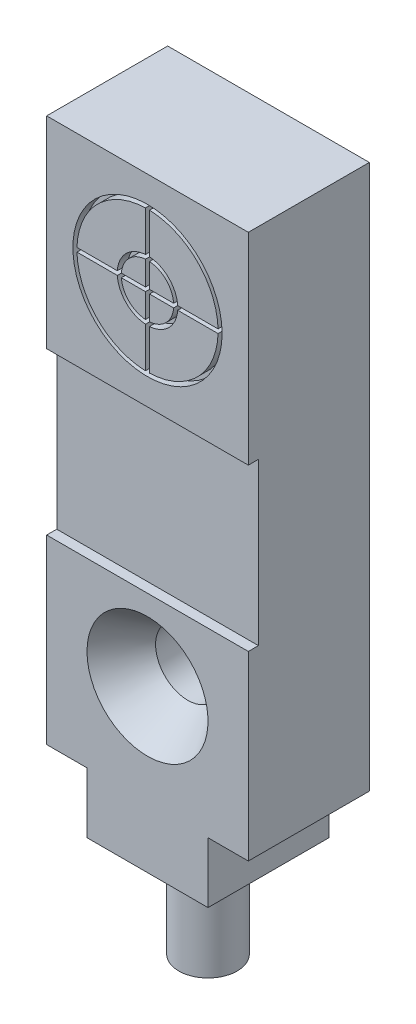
ISO-10303-21;
HEADER;
FILE_DESCRIPTION(('STEP AP214'),'2;1');
FILE_NAME('part.step','',(''),(''),'','','');
FILE_SCHEMA(('AUTOMOTIVE_DESIGN { 1 0 10303 214 1 1 1 1 }'));
ENDSEC;
DATA;
#1=APPLICATION_CONTEXT('core data for automotive mechanical design processes');
#2=APPLICATION_PROTOCOL_DEFINITION('international standard','automotive_design',2000,#1);
#3=PRODUCT_CONTEXT('',#1,'mechanical');
#4=PRODUCT('Part','Part','',(#3));
#5=PRODUCT_RELATED_PRODUCT_CATEGORY('part','',(#4));
#6=PRODUCT_DEFINITION_FORMATION('','',#4);
#7=PRODUCT_DEFINITION_CONTEXT('part definition',#1,'design');
#8=PRODUCT_DEFINITION('design','',#6,#7);
#9=PRODUCT_DEFINITION_SHAPE('','',#8);
#10=(LENGTH_UNIT() NAMED_UNIT(*) SI_UNIT(.MILLI.,.METRE.));
#11=(NAMED_UNIT(*) PLANE_ANGLE_UNIT() SI_UNIT($,.RADIAN.));
#12=(NAMED_UNIT(*) SI_UNIT($,.STERADIAN.) SOLID_ANGLE_UNIT());
#13=UNCERTAINTY_MEASURE_WITH_UNIT(LENGTH_MEASURE(1.E-05),#10,'distance_accuracy_value','');
#14=(GEOMETRIC_REPRESENTATION_CONTEXT(3) GLOBAL_UNCERTAINTY_ASSIGNED_CONTEXT((#13)) GLOBAL_UNIT_ASSIGNED_CONTEXT((#10,
#11,#12)) REPRESENTATION_CONTEXT('',''));
#15=CARTESIAN_POINT('',(0.,0.,0.));
#16=DIRECTION('',(0.,0.,1.));
#17=DIRECTION('',(1.,0.,0.));
#18=AXIS2_PLACEMENT_3D('',#15,#16,#17);
#19=CARTESIAN_POINT('',(10.,0.,6.));
#20=DIRECTION('',(0.,1.,0.));
#21=DIRECTION('',(0.,0.,1.));
#22=AXIS2_PLACEMENT_3D('',#19,#20,#21);
#23=PLANE('',#22);
#24=DIRECTION('',(0.,0.,1.));
#25=VECTOR('',#24,1.);
#26=CARTESIAN_POINT('',(8.,0.,6.));
#27=LINE('',#26,#25);
#28=CARTESIAN_POINT('',(8.,0.,0.));
#29=VERTEX_POINT('',#28);
#30=CARTESIAN_POINT('',(8.,0.,6.));
#31=VERTEX_POINT('',#30);
#32=EDGE_CURVE('E336',#29,#31,#27,.T.);
#33=ORIENTED_EDGE('',*,*,#32,.F.);
#34=DIRECTION('',(1.,0.,0.));
#35=VECTOR('',#34,1.);
#36=CARTESIAN_POINT('',(10.,0.,0.));
#37=LINE('',#36,#35);
#38=CARTESIAN_POINT('',(10.,0.,0.));
#39=VERTEX_POINT('',#38);
#40=EDGE_CURVE('E513',#29,#39,#37,.T.);
#41=ORIENTED_EDGE('',*,*,#40,.T.);
#42=DIRECTION('',(0.,0.,-1.));
#43=VECTOR('',#42,1.);
#44=CARTESIAN_POINT('',(10.,0.,6.));
#45=LINE('',#44,#43);
#46=CARTESIAN_POINT('',(10.,0.,6.));
#47=VERTEX_POINT('',#46);
#48=EDGE_CURVE('E547',#47,#39,#45,.T.);
#49=ORIENTED_EDGE('',*,*,#48,.F.);
#50=DIRECTION('',(1.,0.,0.));
#51=VECTOR('',#50,1.);
#52=CARTESIAN_POINT('',(10.,0.,6.));
#53=LINE('',#52,#51);
#54=EDGE_CURVE('E74',#31,#47,#53,.T.);
#55=ORIENTED_EDGE('',*,*,#54,.F.);
#56=EDGE_LOOP('',(#33,#41,#49,#55));
#57=FACE_BOUND('',#56,.T.);
#58=ADVANCED_FACE('F59',(#57),#23,.F.);
#59=DIRECTION('',(0.,0.,-1.));
#60=VECTOR('',#59,1.);
#61=CARTESIAN_POINT('',(2.,0.,0.));
#62=LINE('',#61,#60);
#63=CARTESIAN_POINT('',(1.99999999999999,0.,6.));
#64=VERTEX_POINT('',#63);
#65=CARTESIAN_POINT('',(2.,0.,0.));
#66=VERTEX_POINT('',#65);
#67=EDGE_CURVE('E82',#64,#66,#62,.T.);
#68=ORIENTED_EDGE('',*,*,#67,.F.);
#69=CARTESIAN_POINT('',(0.,0.,6.));
#70=VERTEX_POINT('',#69);
#71=EDGE_CURVE('E340',#70,#64,#53,.T.);
#72=ORIENTED_EDGE('',*,*,#71,.F.);
#73=DIRECTION('',(0.,0.,-1.));
#74=VECTOR('',#73,1.);
#75=CARTESIAN_POINT('',(0.,0.,6.));
#76=LINE('',#75,#74);
#77=CARTESIAN_POINT('',(0.,0.,0.));
#78=VERTEX_POINT('',#77);
#79=EDGE_CURVE('E530',#70,#78,#76,.T.);
#80=ORIENTED_EDGE('',*,*,#79,.T.);
#81=EDGE_CURVE('E531',#78,#66,#37,.T.);
#82=ORIENTED_EDGE('',*,*,#81,.T.);
#83=EDGE_LOOP('',(#68,#72,#80,#82));
#84=FACE_BOUND('',#83,.T.);
#85=ADVANCED_FACE('F710',(#84),#23,.F.);
#86=CARTESIAN_POINT('',(5.,22.,5.5));
#87=DIRECTION('',(0.,0.,1.));
#88=DIRECTION('',(1.,0.,0.));
#89=AXIS2_PLACEMENT_3D('',#86,#87,#88);
#90=CYLINDRICAL_SURFACE('',#89,3.5);
#91=CARTESIAN_POINT('',(5.,22.,5.5));
#92=DIRECTION('',(0.,0.,1.));
#93=DIRECTION('',(1.,0.,0.));
#94=AXIS2_PLACEMENT_3D('',#91,#92,#93);
#95=CIRCLE('',#94,3.5);
#96=CARTESIAN_POINT('',(1.50142886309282,21.9,5.5));
#97=VERTEX_POINT('',#96);
#98=CARTESIAN_POINT('',(4.9,18.5014288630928,5.5));
#99=VERTEX_POINT('',#98);
#100=EDGE_CURVE('E479',#97,#99,#95,.T.);
#101=ORIENTED_EDGE('',*,*,#100,.T.);
#102=DIRECTION('',(0.,0.,1.));
#103=VECTOR('',#102,1.);
#104=CARTESIAN_POINT('',(4.9,18.5014288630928,5.5));
#105=LINE('',#104,#103);
#106=CARTESIAN_POINT('',(4.9,18.5014288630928,6.));
#107=VERTEX_POINT('',#106);
#108=EDGE_CURVE('E445',#99,#107,#105,.T.);
#109=ORIENTED_EDGE('',*,*,#108,.T.);
#110=CARTESIAN_POINT('',(5.,22.,6.));
#111=DIRECTION('',(0.,0.,1.));
#112=DIRECTION('',(1.,0.,0.));
#113=AXIS2_PLACEMENT_3D('',#110,#111,#112);
#114=CIRCLE('',#113,3.5);
#115=CARTESIAN_POINT('',(1.50142886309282,21.9,6.));
#116=VERTEX_POINT('',#115);
#117=EDGE_CURVE('E484',#116,#107,#114,.T.);
#118=ORIENTED_EDGE('',*,*,#117,.F.);
#119=DIRECTION('',(0.,0.,1.));
#120=VECTOR('',#119,1.);
#121=CARTESIAN_POINT('',(1.50142886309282,21.9,5.5));
#122=LINE('',#121,#120);
#123=EDGE_CURVE('E421',#116,#97,#122,.F.);
#124=ORIENTED_EDGE('',*,*,#123,.T.);
#125=EDGE_LOOP('',(#101,#109,#118,#124));
#126=FACE_BOUND('',#125,.T.);
#127=ADVANCED_FACE('F714',(#126),#90,.T.);
#128=DIRECTION('',(0.,0.,1.));
#129=VECTOR('',#128,1.);
#130=CARTESIAN_POINT('',(5.1,18.5014288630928,5.5));
#131=LINE('',#130,#129);
#132=CARTESIAN_POINT('',(5.1,18.5014288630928,5.5));
#133=VERTEX_POINT('',#132);
#134=CARTESIAN_POINT('',(5.1,18.5014288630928,6.));
#135=VERTEX_POINT('',#134);
#136=EDGE_CURVE('E453',#133,#135,#131,.T.);
#137=ORIENTED_EDGE('',*,*,#136,.F.);
#138=CARTESIAN_POINT('',(8.49857113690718,21.9,5.5));
#139=VERTEX_POINT('',#138);
#140=EDGE_CURVE('E476',#133,#139,#95,.T.);
#141=ORIENTED_EDGE('',*,*,#140,.T.);
#142=DIRECTION('',(0.,0.,1.));
#143=VECTOR('',#142,1.);
#144=CARTESIAN_POINT('',(8.49857113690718,21.9,5.5));
#145=LINE('',#144,#143);
#146=CARTESIAN_POINT('',(8.49857113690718,21.9,6.));
#147=VERTEX_POINT('',#146);
#148=EDGE_CURVE('E399',#139,#147,#145,.T.);
#149=ORIENTED_EDGE('',*,*,#148,.T.);
#150=EDGE_CURVE('E469',#135,#147,#114,.T.);
#151=ORIENTED_EDGE('',*,*,#150,.F.);
#152=EDGE_LOOP('',(#137,#141,#149,#151));
#153=FACE_BOUND('',#152,.T.);
#154=ADVANCED_FACE('F693',(#153),#90,.T.);
#155=CARTESIAN_POINT('',(4.9,25.4985711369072,6.));
#156=VERTEX_POINT('',#155);
#157=CARTESIAN_POINT('',(1.50142886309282,22.1,6.));
#158=VERTEX_POINT('',#157);
#159=EDGE_CURVE('E946',#156,#158,#114,.T.);
#160=ORIENTED_EDGE('',*,*,#159,.F.);
#161=DIRECTION('',(0.,0.,1.));
#162=VECTOR('',#161,1.);
#163=CARTESIAN_POINT('',(4.9,25.4985711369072,5.5));
#164=LINE('',#163,#162);
#165=CARTESIAN_POINT('',(4.9,25.4985711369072,5.5));
#166=VERTEX_POINT('',#165);
#167=EDGE_CURVE('E430',#156,#166,#164,.F.);
#168=ORIENTED_EDGE('',*,*,#167,.T.);
#169=CARTESIAN_POINT('',(1.50142886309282,22.1,5.5));
#170=VERTEX_POINT('',#169);
#171=EDGE_CURVE('E950',#166,#170,#95,.T.);
#172=ORIENTED_EDGE('',*,*,#171,.T.);
#173=DIRECTION('',(0.,0.,1.));
#174=VECTOR('',#173,1.);
#175=CARTESIAN_POINT('',(1.50142886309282,22.1,5.5));
#176=LINE('',#175,#174);
#177=EDGE_CURVE('E414',#158,#170,#176,.F.);
#178=ORIENTED_EDGE('',*,*,#177,.F.);
#179=EDGE_LOOP('',(#160,#168,#172,#178));
#180=FACE_BOUND('',#179,.T.);
#181=ADVANCED_FACE('F822',(#180),#90,.T.);
#182=DIRECTION('',(0.,0.,1.));
#183=VECTOR('',#182,1.);
#184=CARTESIAN_POINT('',(5.1,25.4985711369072,5.5));
#185=LINE('',#184,#183);
#186=CARTESIAN_POINT('',(5.1,25.4985711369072,6.));
#187=VERTEX_POINT('',#186);
#188=CARTESIAN_POINT('',(5.1,25.4985711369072,5.5));
#189=VERTEX_POINT('',#188);
#190=EDGE_CURVE('E438',#187,#189,#185,.F.);
#191=ORIENTED_EDGE('',*,*,#190,.F.);
#192=CARTESIAN_POINT('',(8.49857113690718,22.1,6.));
#193=VERTEX_POINT('',#192);
#194=EDGE_CURVE('E480',#193,#187,#114,.T.);
#195=ORIENTED_EDGE('',*,*,#194,.F.);
#196=DIRECTION('',(0.,0.,1.));
#197=VECTOR('',#196,1.);
#198=CARTESIAN_POINT('',(8.49857113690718,22.1,5.5));
#199=LINE('',#198,#197);
#200=CARTESIAN_POINT('',(8.49857113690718,22.1,5.5));
#201=VERTEX_POINT('',#200);
#202=EDGE_CURVE('E407',#201,#193,#199,.T.);
#203=ORIENTED_EDGE('',*,*,#202,.F.);
#204=EDGE_CURVE('E481',#201,#189,#95,.T.);
#205=ORIENTED_EDGE('',*,*,#204,.T.);
#206=EDGE_LOOP('',(#191,#195,#203,#205));
#207=FACE_BOUND('',#206,.T.);
#208=ADVANCED_FACE('F760',(#207),#90,.T.);
#209=CARTESIAN_POINT('',(0.,0.,6.));
#210=DIRECTION('',(0.,0.,-1.));
#211=DIRECTION('',(-1.,0.,0.));
#212=AXIS2_PLACEMENT_3D('',#209,#210,#211);
#213=PLANE('',#212);
#214=DIRECTION('',(0.,1.,0.));
#215=VECTOR('',#214,1.);
#216=CARTESIAN_POINT('',(4.9,18.5,6.));
#217=LINE('',#216,#215);
#218=CARTESIAN_POINT('',(4.9,20.5033370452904,6.));
#219=VERTEX_POINT('',#218);
#220=EDGE_CURVE('E389',#107,#219,#217,.T.);
#221=ORIENTED_EDGE('',*,*,#220,.T.);
#222=CARTESIAN_POINT('',(5.,22.,6.));
#223=DIRECTION('',(0.,0.,1.));
#224=DIRECTION('',(1.,0.,0.));
#225=AXIS2_PLACEMENT_3D('',#222,#223,#224);
#226=CIRCLE('',#225,1.5);
#227=CARTESIAN_POINT('',(3.50333704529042,21.9,6.));
#228=VERTEX_POINT('',#227);
#229=EDGE_CURVE('E674',#228,#219,#226,.T.);
#230=ORIENTED_EDGE('',*,*,#229,.F.);
#231=DIRECTION('',(1.,0.,0.));
#232=VECTOR('',#231,1.);
#233=CARTESIAN_POINT('',(8.5,21.9,6.));
#234=LINE('',#233,#232);
#235=EDGE_CURVE('E361',#228,#116,#234,.F.);
#236=ORIENTED_EDGE('',*,*,#235,.T.);
#237=ORIENTED_EDGE('',*,*,#117,.T.);
#238=EDGE_LOOP('',(#221,#230,#236,#237));
#239=FACE_BOUND('',#238,.T.);
#240=ADVANCED_FACE('F737',(#239),#213,.F.);
#241=CARTESIAN_POINT('',(4.9,23.4966629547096,6.));
#242=VERTEX_POINT('',#241);
#243=EDGE_CURVE('E387',#242,#156,#217,.T.);
#244=ORIENTED_EDGE('',*,*,#243,.T.);
#245=ORIENTED_EDGE('',*,*,#159,.T.);
#246=DIRECTION('',(1.,0.,0.));
#247=VECTOR('',#246,1.);
#248=CARTESIAN_POINT('',(8.5,22.1,6.));
#249=LINE('',#248,#247);
#250=CARTESIAN_POINT('',(3.50333704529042,22.1,6.));
#251=VERTEX_POINT('',#250);
#252=EDGE_CURVE('E341',#251,#158,#249,.F.);
#253=ORIENTED_EDGE('',*,*,#252,.F.);
#254=EDGE_CURVE('E475',#242,#251,#226,.T.);
#255=ORIENTED_EDGE('',*,*,#254,.F.);
#256=EDGE_LOOP('',(#244,#245,#253,#255));
#257=FACE_BOUND('',#256,.T.);
#258=ADVANCED_FACE('F804',(#257),#213,.F.);
#259=CARTESIAN_POINT('',(5.1,20.5033370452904,6.));
#260=VERTEX_POINT('',#259);
#261=CARTESIAN_POINT('',(6.49666295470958,21.9,6.));
#262=VERTEX_POINT('',#261);
#263=EDGE_CURVE('E459',#260,#262,#226,.T.);
#264=ORIENTED_EDGE('',*,*,#263,.F.);
#265=DIRECTION('',(0.,1.,0.));
#266=VECTOR('',#265,1.);
#267=CARTESIAN_POINT('',(5.1,18.5,6.));
#268=LINE('',#267,#266);
#269=EDGE_CURVE('E385',#135,#260,#268,.T.);
#270=ORIENTED_EDGE('',*,*,#269,.F.);
#271=ORIENTED_EDGE('',*,*,#150,.T.);
#272=EDGE_CURVE('E354',#147,#262,#234,.F.);
#273=ORIENTED_EDGE('',*,*,#272,.T.);
#274=EDGE_LOOP('',(#264,#270,#271,#273));
#275=FACE_BOUND('',#274,.T.);
#276=ADVANCED_FACE('F688',(#275),#213,.F.);
#277=CARTESIAN_POINT('',(5.,22.,5.5));
#278=DIRECTION('',(0.,0.,1.));
#279=DIRECTION('',(1.,0.,0.));
#280=AXIS2_PLACEMENT_3D('',#277,#278,#279);
#281=CYLINDRICAL_SURFACE('',#280,1.5);
#282=DIRECTION('',(0.,0.,1.));
#283=VECTOR('',#282,1.);
#284=CARTESIAN_POINT('',(4.9,20.5033370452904,5.5));
#285=LINE('',#284,#283);
#286=CARTESIAN_POINT('',(4.9,20.5033370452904,5.5));
#287=VERTEX_POINT('',#286);
#288=EDGE_CURVE('E443',#287,#219,#285,.T.);
#289=ORIENTED_EDGE('',*,*,#288,.F.);
#290=CARTESIAN_POINT('',(5.,22.,5.5));
#291=DIRECTION('',(0.,0.,1.));
#292=DIRECTION('',(1.,0.,0.));
#293=AXIS2_PLACEMENT_3D('',#290,#291,#292);
#294=CIRCLE('',#293,1.5);
#295=CARTESIAN_POINT('',(3.50333704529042,21.9,5.5));
#296=VERTEX_POINT('',#295);
#297=EDGE_CURVE('E672',#296,#287,#294,.T.);
#298=ORIENTED_EDGE('',*,*,#297,.F.);
#299=DIRECTION('',(0.,0.,1.));
#300=VECTOR('',#299,1.);
#301=CARTESIAN_POINT('',(3.50333704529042,21.9,5.5));
#302=LINE('',#301,#300);
#303=EDGE_CURVE('E419',#228,#296,#302,.F.);
#304=ORIENTED_EDGE('',*,*,#303,.F.);
#305=ORIENTED_EDGE('',*,*,#229,.T.);
#306=EDGE_LOOP('',(#289,#298,#304,#305));
#307=FACE_BOUND('',#306,.T.);
#308=ADVANCED_FACE('F670',(#307),#281,.F.);
#309=DIRECTION('',(0.,0.,1.));
#310=VECTOR('',#309,1.);
#311=CARTESIAN_POINT('',(4.9,23.4966629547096,5.5));
#312=LINE('',#311,#310);
#313=CARTESIAN_POINT('',(4.9,23.4966629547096,5.5));
#314=VERTEX_POINT('',#313);
#315=EDGE_CURVE('E427',#242,#314,#312,.F.);
#316=ORIENTED_EDGE('',*,*,#315,.F.);
#317=ORIENTED_EDGE('',*,*,#254,.T.);
#318=DIRECTION('',(0.,0.,1.));
#319=VECTOR('',#318,1.);
#320=CARTESIAN_POINT('',(3.50333704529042,22.1,5.5));
#321=LINE('',#320,#319);
#322=CARTESIAN_POINT('',(3.50333704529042,22.1,5.5));
#323=VERTEX_POINT('',#322);
#324=EDGE_CURVE('E411',#251,#323,#321,.F.);
#325=ORIENTED_EDGE('',*,*,#324,.T.);
#326=EDGE_CURVE('E470',#314,#323,#294,.T.);
#327=ORIENTED_EDGE('',*,*,#326,.F.);
#328=EDGE_LOOP('',(#316,#317,#325,#327));
#329=FACE_BOUND('',#328,.T.);
#330=ADVANCED_FACE('F787',(#329),#281,.F.);
#331=CARTESIAN_POINT('',(5.1,20.5033370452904,5.5));
#332=VERTEX_POINT('',#331);
#333=CARTESIAN_POINT('',(6.49666295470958,21.9,5.5));
#334=VERTEX_POINT('',#333);
#335=EDGE_CURVE('E471',#332,#334,#294,.T.);
#336=ORIENTED_EDGE('',*,*,#335,.F.);
#337=DIRECTION('',(0.,0.,1.));
#338=VECTOR('',#337,1.);
#339=CARTESIAN_POINT('',(5.1,20.5033370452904,5.5));
#340=LINE('',#339,#338);
#341=EDGE_CURVE('E450',#332,#260,#340,.T.);
#342=ORIENTED_EDGE('',*,*,#341,.T.);
#343=ORIENTED_EDGE('',*,*,#263,.T.);
#344=DIRECTION('',(0.,0.,1.));
#345=VECTOR('',#344,1.);
#346=CARTESIAN_POINT('',(6.49666295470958,21.9,5.5));
#347=LINE('',#346,#345);
#348=EDGE_CURVE('E397',#334,#262,#347,.T.);
#349=ORIENTED_EDGE('',*,*,#348,.F.);
#350=EDGE_LOOP('',(#336,#342,#343,#349));
#351=FACE_BOUND('',#350,.T.);
#352=ADVANCED_FACE('F681',(#351),#281,.F.);
#353=CARTESIAN_POINT('',(5.,22.,5.5));
#354=DIRECTION('',(0.,0.,1.));
#355=DIRECTION('',(1.,0.,0.));
#356=AXIS2_PLACEMENT_3D('',#353,#354,#355);
#357=CYLINDRICAL_SURFACE('',#356,1.3);
#358=CARTESIAN_POINT('',(5.,22.,5.5));
#359=DIRECTION('',(0.,0.,1.));
#360=DIRECTION('',(1.,0.,0.));
#361=AXIS2_PLACEMENT_3D('',#358,#359,#360);
#362=CIRCLE('',#361,1.3);
#363=CARTESIAN_POINT('',(3.70385186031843,21.9,5.5));
#364=VERTEX_POINT('',#363);
#365=CARTESIAN_POINT('',(4.9,20.7038518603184,5.5));
#366=VERTEX_POINT('',#365);
#367=EDGE_CURVE('E578',#364,#366,#362,.T.);
#368=ORIENTED_EDGE('',*,*,#367,.T.);
#369=DIRECTION('',(0.,0.,1.));
#370=VECTOR('',#369,1.);
#371=CARTESIAN_POINT('',(4.9,20.7038518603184,5.5));
#372=LINE('',#371,#370);
#373=CARTESIAN_POINT('',(4.9,20.7038518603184,6.));
#374=VERTEX_POINT('',#373);
#375=EDGE_CURVE('E440',#366,#374,#372,.T.);
#376=ORIENTED_EDGE('',*,*,#375,.T.);
#377=CARTESIAN_POINT('',(5.,22.,6.));
#378=DIRECTION('',(0.,0.,1.));
#379=DIRECTION('',(1.,0.,0.));
#380=AXIS2_PLACEMENT_3D('',#377,#378,#379);
#381=CIRCLE('',#380,1.3);
#382=CARTESIAN_POINT('',(3.70385186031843,21.9,6.));
#383=VERTEX_POINT('',#382);
#384=EDGE_CURVE('E576',#383,#374,#381,.T.);
#385=ORIENTED_EDGE('',*,*,#384,.F.);
#386=DIRECTION('',(0.,0.,1.));
#387=VECTOR('',#386,1.);
#388=CARTESIAN_POINT('',(3.70385186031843,21.9,5.5));
#389=LINE('',#388,#387);
#390=EDGE_CURVE('E416',#383,#364,#389,.F.);
#391=ORIENTED_EDGE('',*,*,#390,.T.);
#392=EDGE_LOOP('',(#368,#376,#385,#391));
#393=FACE_BOUND('',#392,.T.);
#394=ADVANCED_FACE('F575',(#393),#357,.T.);
#395=CARTESIAN_POINT('',(4.9,23.2961481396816,6.));
#396=VERTEX_POINT('',#395);
#397=CARTESIAN_POINT('',(3.70385186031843,22.1,6.));
#398=VERTEX_POINT('',#397);
#399=EDGE_CURVE('E465',#396,#398,#381,.T.);
#400=ORIENTED_EDGE('',*,*,#399,.F.);
#401=DIRECTION('',(0.,0.,1.));
#402=VECTOR('',#401,1.);
#403=CARTESIAN_POINT('',(4.9,23.2961481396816,5.5));
#404=LINE('',#403,#402);
#405=CARTESIAN_POINT('',(4.9,23.2961481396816,5.5));
#406=VERTEX_POINT('',#405);
#407=EDGE_CURVE('E424',#396,#406,#404,.F.);
#408=ORIENTED_EDGE('',*,*,#407,.T.);
#409=CARTESIAN_POINT('',(3.70385186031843,22.1,5.5));
#410=VERTEX_POINT('',#409);
#411=EDGE_CURVE('E460',#406,#410,#362,.T.);
#412=ORIENTED_EDGE('',*,*,#411,.T.);
#413=DIRECTION('',(0.,0.,1.));
#414=VECTOR('',#413,1.);
#415=CARTESIAN_POINT('',(3.70385186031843,22.1,5.5));
#416=LINE('',#415,#414);
#417=EDGE_CURVE('E409',#398,#410,#416,.F.);
#418=ORIENTED_EDGE('',*,*,#417,.F.);
#419=EDGE_LOOP('',(#400,#408,#412,#418));
#420=FACE_BOUND('',#419,.T.);
#421=ADVANCED_FACE('F609',(#420),#357,.T.);
#422=DIRECTION('',(0.,0.,1.));
#423=VECTOR('',#422,1.);
#424=CARTESIAN_POINT('',(5.1,20.7038518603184,5.5));
#425=LINE('',#424,#423);
#426=CARTESIAN_POINT('',(5.1,20.7038518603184,5.5));
#427=VERTEX_POINT('',#426);
#428=CARTESIAN_POINT('',(5.1,20.7038518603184,6.));
#429=VERTEX_POINT('',#428);
#430=EDGE_CURVE('E448',#427,#429,#425,.T.);
#431=ORIENTED_EDGE('',*,*,#430,.F.);
#432=CARTESIAN_POINT('',(6.29614813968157,21.9,5.5));
#433=VERTEX_POINT('',#432);
#434=EDGE_CURVE('E461',#427,#433,#362,.T.);
#435=ORIENTED_EDGE('',*,*,#434,.T.);
#436=DIRECTION('',(0.,0.,1.));
#437=VECTOR('',#436,1.);
#438=CARTESIAN_POINT('',(6.29614813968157,21.9,5.5));
#439=LINE('',#438,#437);
#440=CARTESIAN_POINT('',(6.29614813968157,21.9,6.));
#441=VERTEX_POINT('',#440);
#442=EDGE_CURVE('E394',#433,#441,#439,.T.);
#443=ORIENTED_EDGE('',*,*,#442,.T.);
#444=EDGE_CURVE('E455',#429,#441,#381,.T.);
#445=ORIENTED_EDGE('',*,*,#444,.F.);
#446=EDGE_LOOP('',(#431,#435,#443,#445));
#447=FACE_BOUND('',#446,.T.);
#448=ADVANCED_FACE('F589',(#447),#357,.T.);
#449=DIRECTION('',(0.,-1.,0.));
#450=VECTOR('',#449,1.);
#451=CARTESIAN_POINT('',(4.9,0.,6.));
#452=LINE('',#451,#450);
#453=CARTESIAN_POINT('',(4.9,21.9,6.));
#454=VERTEX_POINT('',#453);
#455=EDGE_CURVE('E67',#454,#374,#452,.T.);
#456=ORIENTED_EDGE('',*,*,#455,.F.);
#457=EDGE_CURVE('E364',#454,#383,#234,.F.);
#458=ORIENTED_EDGE('',*,*,#457,.T.);
#459=ORIENTED_EDGE('',*,*,#384,.T.);
#460=EDGE_LOOP('',(#456,#458,#459));
#461=FACE_BOUND('',#460,.T.);
#462=ADVANCED_FACE('F579',(#461),#213,.F.);
#463=CARTESIAN_POINT('',(4.9,22.1,6.));
#464=VERTEX_POINT('',#463);
#465=EDGE_CURVE('E393',#464,#396,#217,.T.);
#466=ORIENTED_EDGE('',*,*,#465,.T.);
#467=ORIENTED_EDGE('',*,*,#399,.T.);
#468=EDGE_CURVE('E343',#464,#398,#249,.F.);
#469=ORIENTED_EDGE('',*,*,#468,.F.);
#470=EDGE_LOOP('',(#466,#467,#469));
#471=FACE_BOUND('',#470,.T.);
#472=ADVANCED_FACE('F774',(#471),#213,.F.);
#473=CARTESIAN_POINT('',(6.29614813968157,22.1,6.));
#474=VERTEX_POINT('',#473);
#475=CARTESIAN_POINT('',(5.1,23.2961481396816,6.));
#476=VERTEX_POINT('',#475);
#477=EDGE_CURVE('E462',#474,#476,#381,.T.);
#478=ORIENTED_EDGE('',*,*,#477,.T.);
#479=CARTESIAN_POINT('',(5.1,22.1,6.));
#480=VERTEX_POINT('',#479);
#481=EDGE_CURVE('E388',#480,#476,#268,.T.);
#482=ORIENTED_EDGE('',*,*,#481,.F.);
#483=DIRECTION('',(1.,0.,0.));
#484=VECTOR('',#483,1.);
#485=CARTESIAN_POINT('',(0.,22.1,6.));
#486=LINE('',#485,#484);
#487=EDGE_CURVE('E561',#480,#474,#486,.T.);
#488=ORIENTED_EDGE('',*,*,#487,.T.);
#489=EDGE_LOOP('',(#478,#482,#488));
#490=FACE_BOUND('',#489,.T.);
#491=ADVANCED_FACE('F650',(#490),#213,.F.);
#492=CARTESIAN_POINT('',(5.,5.,6.));
#493=DIRECTION('',(0.,0.,-1.));
#494=DIRECTION('',(-1.,0.,0.));
#495=AXIS2_PLACEMENT_3D('',#492,#493,#494);
#496=CIRCLE('',#495,3.00000000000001);
#497=CARTESIAN_POINT('',(1.99999999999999,5.,6.));
#498=VERTEX_POINT('',#497);
#499=EDGE_CURVE('E553',#498,#498,#496,.T.);
#500=ORIENTED_EDGE('',*,*,#499,.T.);
#501=EDGE_LOOP('',(#500));
#502=FACE_BOUND('',#501,.T.);
#503=DIRECTION('',(0.,1.,0.));
#504=VECTOR('',#503,1.);
#505=CARTESIAN_POINT('',(10.,27.,6.));
#506=LINE('',#505,#504);
#507=CARTESIAN_POINT('',(10.,9.,6.));
#508=VERTEX_POINT('',#507);
#509=EDGE_CURVE('E522',#47,#508,#506,.T.);
#510=ORIENTED_EDGE('',*,*,#509,.T.);
#511=DIRECTION('',(1.,0.,0.));
#512=VECTOR('',#511,1.);
#513=CARTESIAN_POINT('',(10.,9.,6.));
#514=LINE('',#513,#512);
#515=CARTESIAN_POINT('',(0.,9.,6.));
#516=VERTEX_POINT('',#515);
#517=EDGE_CURVE('E499',#516,#508,#514,.T.);
#518=ORIENTED_EDGE('',*,*,#517,.F.);
#519=DIRECTION('',(0.,-1.,0.));
#520=VECTOR('',#519,1.);
#521=CARTESIAN_POINT('',(0.,0.,6.));
#522=LINE('',#521,#520);
#523=EDGE_CURVE('E526',#516,#70,#522,.T.);
#524=ORIENTED_EDGE('',*,*,#523,.T.);
#525=ORIENTED_EDGE('',*,*,#71,.T.);
#526=DIRECTION('',(0.,1.,0.));
#527=VECTOR('',#526,1.);
#528=CARTESIAN_POINT('',(1.99999999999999,-3.,6.));
#529=LINE('',#528,#527);
#530=CARTESIAN_POINT('',(1.99999999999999,-3.,6.));
#531=VERTEX_POINT('',#530);
#532=EDGE_CURVE('E321',#531,#64,#529,.T.);
#533=ORIENTED_EDGE('',*,*,#532,.F.);
#534=DIRECTION('',(-1.,0.,0.));
#535=VECTOR('',#534,1.);
#536=CARTESIAN_POINT('',(1.99999999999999,-3.,6.));
#537=LINE('',#536,#535);
#538=CARTESIAN_POINT('',(8.,-3.,6.));
#539=VERTEX_POINT('',#538);
#540=EDGE_CURVE('E327',#539,#531,#537,.T.);
#541=ORIENTED_EDGE('',*,*,#540,.F.);
#542=DIRECTION('',(0.,1.,0.));
#543=VECTOR('',#542,1.);
#544=CARTESIAN_POINT('',(8.,-3.,6.));
#545=LINE('',#544,#543);
#546=EDGE_CURVE('E1179',#539,#31,#545,.T.);
#547=ORIENTED_EDGE('',*,*,#546,.T.);
#548=ORIENTED_EDGE('',*,*,#54,.T.);
#549=EDGE_LOOP('',(#510,#518,#524,#525,#533,#541,#547,#548));
#550=FACE_BOUND('',#549,.T.);
#551=ADVANCED_FACE('F339',(#502,#550),#213,.F.);
#552=CARTESIAN_POINT('',(10.,27.,6.));
#553=DIRECTION('',(-1.,0.,0.));
#554=DIRECTION('',(0.,0.,1.));
#555=AXIS2_PLACEMENT_3D('',#552,#553,#554);
#556=PLANE('',#555);
#557=DIRECTION('',(0.,1.,0.));
#558=VECTOR('',#557,1.);
#559=CARTESIAN_POINT('',(10.,17.,5.5));
#560=LINE('',#559,#558);
#561=CARTESIAN_POINT('',(10.,9.,5.5));
#562=VERTEX_POINT('',#561);
#563=CARTESIAN_POINT('',(10.,17.,5.5));
#564=VERTEX_POINT('',#563);
#565=EDGE_CURVE('E495',#562,#564,#560,.T.);
#566=ORIENTED_EDGE('',*,*,#565,.F.);
#567=DIRECTION('',(0.,0.,1.));
#568=VECTOR('',#567,1.);
#569=CARTESIAN_POINT('',(10.,9.,5.5));
#570=LINE('',#569,#568);
#571=EDGE_CURVE('E510',#562,#508,#570,.T.);
#572=ORIENTED_EDGE('',*,*,#571,.T.);
#573=ORIENTED_EDGE('',*,*,#509,.F.);
#574=ORIENTED_EDGE('',*,*,#48,.T.);
#575=DIRECTION('',(0.,1.,0.));
#576=VECTOR('',#575,1.);
#577=CARTESIAN_POINT('',(10.,27.,0.));
#578=LINE('',#577,#576);
#579=CARTESIAN_POINT('',(10.,27.,0.));
#580=VERTEX_POINT('',#579);
#581=EDGE_CURVE('E533',#39,#580,#578,.T.);
#582=ORIENTED_EDGE('',*,*,#581,.T.);
#583=DIRECTION('',(0.,0.,-1.));
#584=VECTOR('',#583,1.);
#585=CARTESIAN_POINT('',(10.,27.,6.));
#586=LINE('',#585,#584);
#587=CARTESIAN_POINT('',(10.,27.,6.));
#588=VERTEX_POINT('',#587);
#589=EDGE_CURVE('E544',#588,#580,#586,.T.);
#590=ORIENTED_EDGE('',*,*,#589,.F.);
#591=CARTESIAN_POINT('',(10.,17.,6.));
#592=VERTEX_POINT('',#591);
#593=EDGE_CURVE('E521',#592,#588,#506,.T.);
#594=ORIENTED_EDGE('',*,*,#593,.F.);
#595=DIRECTION('',(0.,0.,1.));
#596=VECTOR('',#595,1.);
#597=CARTESIAN_POINT('',(10.,17.,5.5));
#598=LINE('',#597,#596);
#599=EDGE_CURVE('E507',#564,#592,#598,.T.);
#600=ORIENTED_EDGE('',*,*,#599,.F.);
#601=EDGE_LOOP('',(#566,#572,#573,#574,#582,#590,#594,#600));
#602=FACE_BOUND('',#601,.T.);
#603=ADVANCED_FACE('F716',(#602),#556,.F.);
#604=CARTESIAN_POINT('',(0.,27.,6.));
#605=DIRECTION('',(0.,-1.,0.));
#606=DIRECTION('',(0.,0.,-1.));
#607=AXIS2_PLACEMENT_3D('',#604,#605,#606);
#608=PLANE('',#607);
#609=DIRECTION('',(-1.,0.,0.));
#610=VECTOR('',#609,1.);
#611=CARTESIAN_POINT('',(0.,27.,0.));
#612=LINE('',#611,#610);
#613=CARTESIAN_POINT('',(0.,27.,0.));
#614=VERTEX_POINT('',#613);
#615=EDGE_CURVE('E535',#580,#614,#612,.T.);
#616=ORIENTED_EDGE('',*,*,#615,.T.);
#617=DIRECTION('',(0.,0.,-1.));
#618=VECTOR('',#617,1.);
#619=CARTESIAN_POINT('',(0.,27.,6.));
#620=LINE('',#619,#618);
#621=CARTESIAN_POINT('',(0.,27.,6.));
#622=VERTEX_POINT('',#621);
#623=EDGE_CURVE('E541',#622,#614,#620,.T.);
#624=ORIENTED_EDGE('',*,*,#623,.F.);
#625=DIRECTION('',(-1.,0.,0.));
#626=VECTOR('',#625,1.);
#627=CARTESIAN_POINT('',(0.,27.,6.));
#628=LINE('',#627,#626);
#629=EDGE_CURVE('E524',#588,#622,#628,.T.);
#630=ORIENTED_EDGE('',*,*,#629,.F.);
#631=ORIENTED_EDGE('',*,*,#589,.T.);
#632=EDGE_LOOP('',(#616,#624,#630,#631));
#633=FACE_BOUND('',#632,.T.);
#634=ADVANCED_FACE('F719',(#633),#608,.F.);
#635=CARTESIAN_POINT('',(0.,0.,6.));
#636=DIRECTION('',(1.,0.,0.));
#637=DIRECTION('',(0.,0.,-1.));
#638=AXIS2_PLACEMENT_3D('',#635,#636,#637);
#639=PLANE('',#638);
#640=ORIENTED_EDGE('',*,*,#523,.F.);
#641=DIRECTION('',(0.,0.,1.));
#642=VECTOR('',#641,1.);
#643=CARTESIAN_POINT('',(0.,9.,5.5));
#644=LINE('',#643,#642);
#645=CARTESIAN_POINT('',(0.,9.,5.5));
#646=VERTEX_POINT('',#645);
#647=EDGE_CURVE('E514',#646,#516,#644,.T.);
#648=ORIENTED_EDGE('',*,*,#647,.F.);
#649=DIRECTION('',(0.,-1.,0.));
#650=VECTOR('',#649,1.);
#651=CARTESIAN_POINT('',(0.,9.,5.5));
#652=LINE('',#651,#650);
#653=CARTESIAN_POINT('',(0.,17.,5.5));
#654=VERTEX_POINT('',#653);
#655=EDGE_CURVE('E502',#654,#646,#652,.T.);
#656=ORIENTED_EDGE('',*,*,#655,.F.);
#657=DIRECTION('',(0.,0.,1.));
#658=VECTOR('',#657,1.);
#659=CARTESIAN_POINT('',(0.,17.,5.5));
#660=LINE('',#659,#658);
#661=CARTESIAN_POINT('',(0.,17.,6.));
#662=VERTEX_POINT('',#661);
#663=EDGE_CURVE('E516',#654,#662,#660,.T.);
#664=ORIENTED_EDGE('',*,*,#663,.T.);
#665=EDGE_CURVE('E527',#622,#662,#522,.T.);
#666=ORIENTED_EDGE('',*,*,#665,.F.);
#667=ORIENTED_EDGE('',*,*,#623,.T.);
#668=DIRECTION('',(0.,-1.,0.));
#669=VECTOR('',#668,1.);
#670=CARTESIAN_POINT('',(0.,0.,0.));
#671=LINE('',#670,#669);
#672=EDGE_CURVE('E537',#614,#78,#671,.T.);
#673=ORIENTED_EDGE('',*,*,#672,.T.);
#674=ORIENTED_EDGE('',*,*,#79,.F.);
#675=EDGE_LOOP('',(#640,#648,#656,#664,#666,#667,#673,#674));
#676=FACE_BOUND('',#675,.T.);
#677=ADVANCED_FACE('F723',(#676),#639,.F.);
#678=CARTESIAN_POINT('',(5.,22.,6.));
#679=DIRECTION('',(0.,0.,1.));
#680=DIRECTION('',(1.,0.,0.));
#681=AXIS2_PLACEMENT_3D('',#678,#679,#680);
#682=CIRCLE('',#681,3.7);
#683=CARTESIAN_POINT('',(8.7,22.,6.));
#684=VERTEX_POINT('',#683);
#685=EDGE_CURVE('E489',#684,#684,#682,.T.);
#686=ORIENTED_EDGE('',*,*,#685,.F.);
#687=EDGE_LOOP('',(#686));
#688=FACE_BOUND('',#687,.T.);
#689=ORIENTED_EDGE('',*,*,#665,.T.);
#690=DIRECTION('',(-1.,0.,0.));
#691=VECTOR('',#690,1.);
#692=CARTESIAN_POINT('',(0.,17.,6.));
#693=LINE('',#692,#691);
#694=EDGE_CURVE('E494',#592,#662,#693,.T.);
#695=ORIENTED_EDGE('',*,*,#694,.F.);
#696=ORIENTED_EDGE('',*,*,#593,.T.);
#697=ORIENTED_EDGE('',*,*,#629,.T.);
#698=EDGE_LOOP('',(#689,#695,#696,#697));
#699=FACE_BOUND('',#698,.T.);
#700=ADVANCED_FACE('F727',(#688,#699),#213,.F.);
#701=CARTESIAN_POINT('',(0.,0.,0.));
#702=DIRECTION('',(0.,0.,-1.));
#703=DIRECTION('',(-1.,0.,0.));
#704=AXIS2_PLACEMENT_3D('',#701,#702,#703);
#705=PLANE('',#704);
#706=CARTESIAN_POINT('',(5.,5.,0.));
#707=DIRECTION('',(0.,0.,1.));
#708=DIRECTION('',(1.,0.,0.));
#709=AXIS2_PLACEMENT_3D('',#706,#707,#708);
#710=CIRCLE('',#709,1.6);
#711=CARTESIAN_POINT('',(6.6,5.,0.));
#712=VERTEX_POINT('',#711);
#713=EDGE_CURVE('E488',#712,#712,#710,.T.);
#714=ORIENTED_EDGE('',*,*,#713,.T.);
#715=EDGE_LOOP('',(#714));
#716=FACE_BOUND('',#715,.T.);
#717=ORIENTED_EDGE('',*,*,#81,.F.);
#718=ORIENTED_EDGE('',*,*,#672,.F.);
#719=ORIENTED_EDGE('',*,*,#615,.F.);
#720=ORIENTED_EDGE('',*,*,#581,.F.);
#721=ORIENTED_EDGE('',*,*,#40,.F.);
#722=DIRECTION('',(0.,1.,0.));
#723=VECTOR('',#722,1.);
#724=CARTESIAN_POINT('',(8.,-3.,0.));
#725=LINE('',#724,#723);
#726=CARTESIAN_POINT('',(8.,-3.,0.));
#727=VERTEX_POINT('',#726);
#728=EDGE_CURVE('E346',#727,#29,#725,.T.);
#729=ORIENTED_EDGE('',*,*,#728,.F.);
#730=DIRECTION('',(1.,0.,0.));
#731=VECTOR('',#730,1.);
#732=CARTESIAN_POINT('',(8.,-3.,0.));
#733=LINE('',#732,#731);
#734=CARTESIAN_POINT('',(2.,-3.,0.));
#735=VERTEX_POINT('',#734);
#736=EDGE_CURVE('E326',#735,#727,#733,.T.);
#737=ORIENTED_EDGE('',*,*,#736,.F.);
#738=DIRECTION('',(0.,1.,0.));
#739=VECTOR('',#738,1.);
#740=CARTESIAN_POINT('',(2.,-3.,0.));
#741=LINE('',#740,#739);
#742=EDGE_CURVE('E323',#735,#66,#741,.T.);
#743=ORIENTED_EDGE('',*,*,#742,.T.);
#744=EDGE_LOOP('',(#717,#718,#719,#720,#721,#729,#737,#743));
#745=FACE_BOUND('',#744,.T.);
#746=ADVANCED_FACE('F729',(#716,#745),#705,.T.);
#747=CARTESIAN_POINT('',(10.,9.,5.5));
#748=DIRECTION('',(0.,-1.,0.));
#749=DIRECTION('',(1.,0.,0.));
#750=AXIS2_PLACEMENT_3D('',#747,#748,#749);
#751=PLANE('',#750);
#752=ORIENTED_EDGE('',*,*,#517,.T.);
#753=ORIENTED_EDGE('',*,*,#571,.F.);
#754=DIRECTION('',(1.,0.,0.));
#755=VECTOR('',#754,1.);
#756=CARTESIAN_POINT('',(10.,9.,5.5));
#757=LINE('',#756,#755);
#758=EDGE_CURVE('E504',#646,#562,#757,.T.);
#759=ORIENTED_EDGE('',*,*,#758,.F.);
#760=ORIENTED_EDGE('',*,*,#647,.T.);
#761=EDGE_LOOP('',(#752,#753,#759,#760));
#762=FACE_BOUND('',#761,.T.);
#763=ADVANCED_FACE('F732',(#762),#751,.F.);
#764=CARTESIAN_POINT('',(0.,17.,5.5));
#765=DIRECTION('',(0.,1.,0.));
#766=DIRECTION('',(0.,0.,1.));
#767=AXIS2_PLACEMENT_3D('',#764,#765,#766);
#768=PLANE('',#767);
#769=ORIENTED_EDGE('',*,*,#694,.T.);
#770=ORIENTED_EDGE('',*,*,#663,.F.);
#771=DIRECTION('',(-1.,0.,0.));
#772=VECTOR('',#771,1.);
#773=CARTESIAN_POINT('',(0.,17.,5.5));
#774=LINE('',#773,#772);
#775=EDGE_CURVE('E498',#564,#654,#774,.T.);
#776=ORIENTED_EDGE('',*,*,#775,.F.);
#777=ORIENTED_EDGE('',*,*,#599,.T.);
#778=EDGE_LOOP('',(#769,#770,#776,#777));
#779=FACE_BOUND('',#778,.T.);
#780=ADVANCED_FACE('F738',(#779),#768,.F.);
#781=CARTESIAN_POINT('',(0.,0.,5.5));
#782=DIRECTION('',(0.,0.,-1.));
#783=DIRECTION('',(-1.,0.,0.));
#784=AXIS2_PLACEMENT_3D('',#781,#782,#783);
#785=PLANE('',#784);
#786=ORIENTED_EDGE('',*,*,#565,.T.);
#787=ORIENTED_EDGE('',*,*,#775,.T.);
#788=ORIENTED_EDGE('',*,*,#655,.T.);
#789=ORIENTED_EDGE('',*,*,#758,.T.);
#790=EDGE_LOOP('',(#786,#787,#788,#789));
#791=FACE_BOUND('',#790,.T.);
#792=ADVANCED_FACE('F741',(#791),#785,.F.);
#793=CARTESIAN_POINT('',(5.,5.,0.));
#794=DIRECTION('',(0.,0.,1.));
#795=DIRECTION('',(1.,0.,0.));
#796=AXIS2_PLACEMENT_3D('',#793,#794,#795);
#797=CYLINDRICAL_SURFACE('',#796,1.6);
#798=CARTESIAN_POINT('',(5.,5.,3.99999999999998));
#799=DIRECTION('',(0.,0.,-1.));
#800=DIRECTION('',(-1.,0.,0.));
#801=AXIS2_PLACEMENT_3D('',#798,#799,#800);
#802=CIRCLE('',#801,1.6);
#803=CARTESIAN_POINT('',(3.4,5.,3.99999999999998));
#804=VERTEX_POINT('',#803);
#805=EDGE_CURVE('E550',#804,#804,#802,.F.);
#806=ORIENTED_EDGE('',*,*,#805,.T.);
#807=EDGE_LOOP('',(#806));
#808=FACE_BOUND('',#807,.T.);
#809=ORIENTED_EDGE('',*,*,#713,.F.);
#810=EDGE_LOOP('',(#809));
#811=FACE_BOUND('',#810,.T.);
#812=ADVANCED_FACE('F748',(#808,#811),#797,.F.);
#813=CARTESIAN_POINT('',(5.,5.,3.99999999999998));
#814=DIRECTION('',(0.,0.,1.));
#815=DIRECTION('',(1.,0.,0.));
#816=AXIS2_PLACEMENT_3D('',#813,#814,#815);
#817=CONICAL_SURFACE('',#816,1.6,0.610725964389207);
#818=ORIENTED_EDGE('',*,*,#499,.F.);
#819=EDGE_LOOP('',(#818));
#820=FACE_BOUND('',#819,.T.);
#821=ORIENTED_EDGE('',*,*,#805,.F.);
#822=EDGE_LOOP('',(#821));
#823=FACE_BOUND('',#822,.T.);
#824=ADVANCED_FACE('F61',(#820,#823),#817,.F.);
#825=CARTESIAN_POINT('',(5.,22.,5.5));
#826=DIRECTION('',(0.,0.,1.));
#827=DIRECTION('',(1.,0.,0.));
#828=AXIS2_PLACEMENT_3D('',#825,#826,#827);
#829=CYLINDRICAL_SURFACE('',#828,3.7);
#830=CARTESIAN_POINT('',(5.,22.,5.5));
#831=DIRECTION('',(0.,0.,1.));
#832=DIRECTION('',(1.,0.,0.));
#833=AXIS2_PLACEMENT_3D('',#830,#831,#832);
#834=CIRCLE('',#833,3.7);
#835=CARTESIAN_POINT('',(8.7,22.,5.5));
#836=VERTEX_POINT('',#835);
#837=EDGE_CURVE('E485',#836,#836,#834,.T.);
#838=ORIENTED_EDGE('',*,*,#837,.F.);
#839=EDGE_LOOP('',(#838));
#840=FACE_BOUND('',#839,.T.);
#841=ORIENTED_EDGE('',*,*,#685,.T.);
#842=EDGE_LOOP('',(#841));
#843=FACE_BOUND('',#842,.T.);
#844=ADVANCED_FACE('F753',(#840,#843),#829,.F.);
#845=CARTESIAN_POINT('',(5.,22.,5.5));
#846=DIRECTION('',(0.,0.,1.));
#847=DIRECTION('',(1.,0.,0.));
#848=AXIS2_PLACEMENT_3D('',#845,#846,#847);
#849=PLANE('',#848);
#850=ORIENTED_EDGE('',*,*,#140,.F.);
#851=DIRECTION('',(0.,1.,0.));
#852=VECTOR('',#851,1.);
#853=CARTESIAN_POINT('',(5.1,18.5,5.5));
#854=LINE('',#853,#852);
#855=EDGE_CURVE('E379',#133,#332,#854,.T.);
#856=ORIENTED_EDGE('',*,*,#855,.T.);
#857=ORIENTED_EDGE('',*,*,#335,.T.);
#858=DIRECTION('',(1.,0.,0.));
#859=VECTOR('',#858,1.);
#860=CARTESIAN_POINT('',(8.5,21.9,5.5));
#861=LINE('',#860,#859);
#862=EDGE_CURVE('E368',#139,#334,#861,.F.);
#863=ORIENTED_EDGE('',*,*,#862,.F.);
#864=EDGE_LOOP('',(#850,#856,#857,#863));
#865=FACE_BOUND('',#864,.T.);
#866=DIRECTION('',(0.,1.,0.));
#867=VECTOR('',#866,1.);
#868=CARTESIAN_POINT('',(4.9,18.5,5.5));
#869=LINE('',#868,#867);
#870=EDGE_CURVE('E383',#99,#287,#869,.T.);
#871=ORIENTED_EDGE('',*,*,#870,.F.);
#872=ORIENTED_EDGE('',*,*,#100,.F.);
#873=EDGE_CURVE('E356',#296,#97,#861,.F.);
#874=ORIENTED_EDGE('',*,*,#873,.F.);
#875=ORIENTED_EDGE('',*,*,#297,.T.);
#876=EDGE_LOOP('',(#871,#872,#874,#875));
#877=FACE_BOUND('',#876,.T.);
#878=CARTESIAN_POINT('',(5.1,23.4966629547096,5.5));
#879=VERTEX_POINT('',#878);
#880=EDGE_CURVE('E392',#879,#189,#854,.T.);
#881=ORIENTED_EDGE('',*,*,#880,.T.);
#882=ORIENTED_EDGE('',*,*,#204,.F.);
#883=DIRECTION('',(1.,0.,0.));
#884=VECTOR('',#883,1.);
#885=CARTESIAN_POINT('',(8.5,22.1,5.5));
#886=LINE('',#885,#884);
#887=CARTESIAN_POINT('',(6.49666295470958,22.1,5.5));
#888=VERTEX_POINT('',#887);
#889=EDGE_CURVE('E358',#201,#888,#886,.F.);
#890=ORIENTED_EDGE('',*,*,#889,.T.);
#891=EDGE_CURVE('E466',#888,#879,#294,.T.);
#892=ORIENTED_EDGE('',*,*,#891,.T.);
#893=EDGE_LOOP('',(#881,#882,#890,#892));
#894=FACE_BOUND('',#893,.T.);
#895=ORIENTED_EDGE('',*,*,#171,.F.);
#896=EDGE_CURVE('E653',#314,#166,#869,.T.);
#897=ORIENTED_EDGE('',*,*,#896,.F.);
#898=ORIENTED_EDGE('',*,*,#326,.T.);
#899=EDGE_CURVE('E350',#323,#170,#886,.F.);
#900=ORIENTED_EDGE('',*,*,#899,.T.);
#901=EDGE_LOOP('',(#895,#897,#898,#900));
#902=FACE_BOUND('',#901,.T.);
#903=ORIENTED_EDGE('',*,*,#434,.F.);
#904=CARTESIAN_POINT('',(5.1,21.9,5.5));
#905=VERTEX_POINT('',#904);
#906=EDGE_CURVE('E377',#427,#905,#854,.T.);
#907=ORIENTED_EDGE('',*,*,#906,.T.);
#908=EDGE_CURVE('E359',#433,#905,#861,.F.);
#909=ORIENTED_EDGE('',*,*,#908,.F.);
#910=EDGE_LOOP('',(#903,#907,#909));
#911=FACE_BOUND('',#910,.T.);
#912=CARTESIAN_POINT('',(4.9,21.9,5.5));
#913=VERTEX_POINT('',#912);
#914=EDGE_CURVE('E381',#366,#913,#869,.T.);
#915=ORIENTED_EDGE('',*,*,#914,.F.);
#916=ORIENTED_EDGE('',*,*,#367,.F.);
#917=EDGE_CURVE('E357',#913,#364,#861,.F.);
#918=ORIENTED_EDGE('',*,*,#917,.F.);
#919=EDGE_LOOP('',(#915,#916,#918));
#920=FACE_BOUND('',#919,.T.);
#921=CARTESIAN_POINT('',(5.1,22.1,5.5));
#922=VERTEX_POINT('',#921);
#923=CARTESIAN_POINT('',(5.1,23.2961481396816,5.5));
#924=VERTEX_POINT('',#923);
#925=EDGE_CURVE('E380',#922,#924,#854,.T.);
#926=ORIENTED_EDGE('',*,*,#925,.T.);
#927=CARTESIAN_POINT('',(6.29614813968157,22.1,5.5));
#928=VERTEX_POINT('',#927);
#929=EDGE_CURVE('E456',#928,#924,#362,.T.);
#930=ORIENTED_EDGE('',*,*,#929,.F.);
#931=EDGE_CURVE('E355',#928,#922,#886,.F.);
#932=ORIENTED_EDGE('',*,*,#931,.T.);
#933=EDGE_LOOP('',(#926,#930,#932));
#934=FACE_BOUND('',#933,.T.);
#935=ORIENTED_EDGE('',*,*,#411,.F.);
#936=CARTESIAN_POINT('',(4.9,22.1,5.5));
#937=VERTEX_POINT('',#936);
#938=EDGE_CURVE('E384',#937,#406,#869,.T.);
#939=ORIENTED_EDGE('',*,*,#938,.F.);
#940=EDGE_CURVE('E353',#937,#410,#886,.F.);
#941=ORIENTED_EDGE('',*,*,#940,.T.);
#942=EDGE_LOOP('',(#935,#939,#941));
#943=FACE_BOUND('',#942,.T.);
#944=ORIENTED_EDGE('',*,*,#837,.T.);
#945=EDGE_LOOP('',(#944));
#946=FACE_BOUND('',#945,.T.);
#947=ADVANCED_FACE('F598',(#865,#877,#894,#902,#911,#920,#934,#943,#946),#849,.T.);
#948=ORIENTED_EDGE('',*,*,#194,.T.);
#949=CARTESIAN_POINT('',(5.1,23.4966629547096,6.));
#950=VERTEX_POINT('',#949);
#951=EDGE_CURVE('E376',#950,#187,#268,.T.);
#952=ORIENTED_EDGE('',*,*,#951,.F.);
#953=CARTESIAN_POINT('',(6.49666295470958,22.1,6.));
#954=VERTEX_POINT('',#953);
#955=EDGE_CURVE('E472',#954,#950,#226,.T.);
#956=ORIENTED_EDGE('',*,*,#955,.F.);
#957=EDGE_CURVE('E345',#193,#954,#249,.F.);
#958=ORIENTED_EDGE('',*,*,#957,.F.);
#959=EDGE_LOOP('',(#948,#952,#956,#958));
#960=FACE_BOUND('',#959,.T.);
#961=ADVANCED_FACE('F634',(#960),#213,.F.);
#962=ORIENTED_EDGE('',*,*,#955,.T.);
#963=DIRECTION('',(0.,0.,1.));
#964=VECTOR('',#963,1.);
#965=CARTESIAN_POINT('',(5.1,23.4966629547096,5.5));
#966=LINE('',#965,#964);
#967=EDGE_CURVE('E435',#950,#879,#966,.F.);
#968=ORIENTED_EDGE('',*,*,#967,.T.);
#969=ORIENTED_EDGE('',*,*,#891,.F.);
#970=DIRECTION('',(0.,0.,1.));
#971=VECTOR('',#970,1.);
#972=CARTESIAN_POINT('',(6.49666295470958,22.1,5.5));
#973=LINE('',#972,#971);
#974=EDGE_CURVE('E404',#888,#954,#973,.T.);
#975=ORIENTED_EDGE('',*,*,#974,.T.);
#976=EDGE_LOOP('',(#962,#968,#969,#975));
#977=FACE_BOUND('',#976,.T.);
#978=ADVANCED_FACE('F626',(#977),#281,.F.);
#979=DIRECTION('',(0.,0.,1.));
#980=VECTOR('',#979,1.);
#981=CARTESIAN_POINT('',(5.1,23.2961481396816,5.5));
#982=LINE('',#981,#980);
#983=EDGE_CURVE('E433',#476,#924,#982,.F.);
#984=ORIENTED_EDGE('',*,*,#983,.F.);
#985=ORIENTED_EDGE('',*,*,#477,.F.);
#986=DIRECTION('',(0.,0.,1.));
#987=VECTOR('',#986,1.);
#988=CARTESIAN_POINT('',(6.29614813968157,22.1,5.5));
#989=LINE('',#988,#987);
#990=EDGE_CURVE('E402',#928,#474,#989,.T.);
#991=ORIENTED_EDGE('',*,*,#990,.F.);
#992=ORIENTED_EDGE('',*,*,#929,.T.);
#993=EDGE_LOOP('',(#984,#985,#991,#992));
#994=FACE_BOUND('',#993,.T.);
#995=ADVANCED_FACE('F647',(#994),#357,.T.);
#996=DIRECTION('',(1.,0.,0.));
#997=VECTOR('',#996,1.);
#998=CARTESIAN_POINT('',(0.,21.9,6.));
#999=LINE('',#998,#997);
#1000=CARTESIAN_POINT('',(5.1,21.9,6.));
#1001=VERTEX_POINT('',#1000);
#1002=EDGE_CURVE('E556',#1001,#441,#999,.T.);
#1003=ORIENTED_EDGE('',*,*,#1002,.F.);
#1004=DIRECTION('',(0.,-1.,0.));
#1005=VECTOR('',#1004,1.);
#1006=CARTESIAN_POINT('',(5.1,0.,6.));
#1007=LINE('',#1006,#1005);
#1008=EDGE_CURVE('E558',#1001,#429,#1007,.T.);
#1009=ORIENTED_EDGE('',*,*,#1008,.T.);
#1010=ORIENTED_EDGE('',*,*,#444,.T.);
#1011=EDGE_LOOP('',(#1003,#1009,#1010));
#1012=FACE_BOUND('',#1011,.T.);
#1013=ADVANCED_FACE('F585',(#1012),#213,.F.);
#1014=CARTESIAN_POINT('',(8.5,21.9,5.5));
#1015=DIRECTION('',(0.,1.,0.));
#1016=DIRECTION('',(0.,0.,1.));
#1017=AXIS2_PLACEMENT_3D('',#1014,#1015,#1016);
#1018=PLANE('',#1017);
#1019=ORIENTED_EDGE('',*,*,#908,.T.);
#1020=DIRECTION('',(0.,0.,1.));
#1021=VECTOR('',#1020,1.);
#1022=CARTESIAN_POINT('',(5.1,21.9,5.5));
#1023=LINE('',#1022,#1021);
#1024=EDGE_CURVE('E367',#905,#1001,#1023,.T.);
#1025=ORIENTED_EDGE('',*,*,#1024,.T.);
#1026=ORIENTED_EDGE('',*,*,#1002,.T.);
#1027=ORIENTED_EDGE('',*,*,#442,.F.);
#1028=EDGE_LOOP('',(#1019,#1025,#1026,#1027));
#1029=FACE_BOUND('',#1028,.T.);
#1030=ADVANCED_FACE('F595',(#1029),#1018,.T.);
#1031=CARTESIAN_POINT('',(5.1,18.5,5.5));
#1032=DIRECTION('',(1.,0.,0.));
#1033=DIRECTION('',(0.,0.,-1.));
#1034=AXIS2_PLACEMENT_3D('',#1031,#1032,#1033);
#1035=PLANE('',#1034);
#1036=ORIENTED_EDGE('',*,*,#430,.T.);
#1037=ORIENTED_EDGE('',*,*,#1008,.F.);
#1038=ORIENTED_EDGE('',*,*,#1024,.F.);
#1039=ORIENTED_EDGE('',*,*,#906,.F.);
#1040=EDGE_LOOP('',(#1036,#1037,#1038,#1039));
#1041=FACE_BOUND('',#1040,.T.);
#1042=ADVANCED_FACE('F705',(#1041),#1035,.F.);
#1043=CARTESIAN_POINT('',(8.5,22.1,5.5));
#1044=DIRECTION('',(0.,1.,0.));
#1045=DIRECTION('',(0.,0.,1.));
#1046=AXIS2_PLACEMENT_3D('',#1043,#1044,#1045);
#1047=PLANE('',#1046);
#1048=ORIENTED_EDGE('',*,*,#990,.T.);
#1049=ORIENTED_EDGE('',*,*,#487,.F.);
#1050=DIRECTION('',(0.,0.,1.));
#1051=VECTOR('',#1050,1.);
#1052=CARTESIAN_POINT('',(5.1,22.1,5.5));
#1053=LINE('',#1052,#1051);
#1054=EDGE_CURVE('E373',#922,#480,#1053,.T.);
#1055=ORIENTED_EDGE('',*,*,#1054,.F.);
#1056=ORIENTED_EDGE('',*,*,#931,.F.);
#1057=EDGE_LOOP('',(#1048,#1049,#1055,#1056));
#1058=FACE_BOUND('',#1057,.T.);
#1059=ADVANCED_FACE('F652',(#1058),#1047,.F.);
#1060=ORIENTED_EDGE('',*,*,#983,.T.);
#1061=ORIENTED_EDGE('',*,*,#925,.F.);
#1062=ORIENTED_EDGE('',*,*,#1054,.T.);
#1063=ORIENTED_EDGE('',*,*,#481,.T.);
#1064=EDGE_LOOP('',(#1060,#1061,#1062,#1063));
#1065=FACE_BOUND('',#1064,.T.);
#1066=ADVANCED_FACE('F640',(#1065),#1035,.F.);
#1067=ORIENTED_EDGE('',*,*,#417,.T.);
#1068=ORIENTED_EDGE('',*,*,#940,.F.);
#1069=DIRECTION('',(0.,0.,1.));
#1070=VECTOR('',#1069,1.);
#1071=CARTESIAN_POINT('',(4.9,22.1,5.5));
#1072=LINE('',#1071,#1070);
#1073=EDGE_CURVE('E370',#937,#464,#1072,.T.);
#1074=ORIENTED_EDGE('',*,*,#1073,.T.);
#1075=ORIENTED_EDGE('',*,*,#468,.T.);
#1076=EDGE_LOOP('',(#1067,#1068,#1074,#1075));
#1077=FACE_BOUND('',#1076,.T.);
#1078=ADVANCED_FACE('F708',(#1077),#1047,.F.);
#1079=CARTESIAN_POINT('',(4.9,18.5,5.5));
#1080=DIRECTION('',(1.,0.,0.));
#1081=DIRECTION('',(0.,0.,-1.));
#1082=AXIS2_PLACEMENT_3D('',#1079,#1080,#1081);
#1083=PLANE('',#1082);
#1084=ORIENTED_EDGE('',*,*,#465,.F.);
#1085=ORIENTED_EDGE('',*,*,#1073,.F.);
#1086=ORIENTED_EDGE('',*,*,#938,.T.);
#1087=ORIENTED_EDGE('',*,*,#407,.F.);
#1088=EDGE_LOOP('',(#1084,#1085,#1086,#1087));
#1089=FACE_BOUND('',#1088,.T.);
#1090=ADVANCED_FACE('F704',(#1089),#1083,.T.);
#1091=ORIENTED_EDGE('',*,*,#457,.F.);
#1092=DIRECTION('',(0.,0.,1.));
#1093=VECTOR('',#1092,1.);
#1094=CARTESIAN_POINT('',(4.9,21.9,5.5));
#1095=LINE('',#1094,#1093);
#1096=EDGE_CURVE('E365',#913,#454,#1095,.T.);
#1097=ORIENTED_EDGE('',*,*,#1096,.F.);
#1098=ORIENTED_EDGE('',*,*,#917,.T.);
#1099=ORIENTED_EDGE('',*,*,#390,.F.);
#1100=EDGE_LOOP('',(#1091,#1097,#1098,#1099));
#1101=FACE_BOUND('',#1100,.T.);
#1102=ADVANCED_FACE('F602',(#1101),#1018,.T.);
#1103=ORIENTED_EDGE('',*,*,#914,.T.);
#1104=ORIENTED_EDGE('',*,*,#1096,.T.);
#1105=ORIENTED_EDGE('',*,*,#455,.T.);
#1106=ORIENTED_EDGE('',*,*,#375,.F.);
#1107=EDGE_LOOP('',(#1103,#1104,#1105,#1106));
#1108=FACE_BOUND('',#1107,.T.);
#1109=ADVANCED_FACE('F565',(#1108),#1083,.T.);
#1110=ORIENTED_EDGE('',*,*,#202,.T.);
#1111=ORIENTED_EDGE('',*,*,#957,.T.);
#1112=ORIENTED_EDGE('',*,*,#974,.F.);
#1113=ORIENTED_EDGE('',*,*,#889,.F.);
#1114=EDGE_LOOP('',(#1110,#1111,#1112,#1113));
#1115=FACE_BOUND('',#1114,.T.);
#1116=ADVANCED_FACE('F928',(#1115),#1047,.F.);
#1117=ORIENTED_EDGE('',*,*,#862,.T.);
#1118=ORIENTED_EDGE('',*,*,#348,.T.);
#1119=ORIENTED_EDGE('',*,*,#272,.F.);
#1120=ORIENTED_EDGE('',*,*,#148,.F.);
#1121=EDGE_LOOP('',(#1117,#1118,#1119,#1120));
#1122=FACE_BOUND('',#1121,.T.);
#1123=ADVANCED_FACE('F686',(#1122),#1018,.T.);
#1124=ORIENTED_EDGE('',*,*,#235,.F.);
#1125=ORIENTED_EDGE('',*,*,#303,.T.);
#1126=ORIENTED_EDGE('',*,*,#873,.T.);
#1127=ORIENTED_EDGE('',*,*,#123,.F.);
#1128=EDGE_LOOP('',(#1124,#1125,#1126,#1127));
#1129=FACE_BOUND('',#1128,.T.);
#1130=ADVANCED_FACE('F919',(#1129),#1018,.T.);
#1131=ORIENTED_EDGE('',*,*,#177,.T.);
#1132=ORIENTED_EDGE('',*,*,#899,.F.);
#1133=ORIENTED_EDGE('',*,*,#324,.F.);
#1134=ORIENTED_EDGE('',*,*,#252,.T.);
#1135=EDGE_LOOP('',(#1131,#1132,#1133,#1134));
#1136=FACE_BOUND('',#1135,.T.);
#1137=ADVANCED_FACE('F921',(#1136),#1047,.F.);
#1138=ORIENTED_EDGE('',*,*,#243,.F.);
#1139=ORIENTED_EDGE('',*,*,#315,.T.);
#1140=ORIENTED_EDGE('',*,*,#896,.T.);
#1141=ORIENTED_EDGE('',*,*,#167,.F.);
#1142=EDGE_LOOP('',(#1138,#1139,#1140,#1141));
#1143=FACE_BOUND('',#1142,.T.);
#1144=ADVANCED_FACE('F703',(#1143),#1083,.T.);
#1145=ORIENTED_EDGE('',*,*,#190,.T.);
#1146=ORIENTED_EDGE('',*,*,#880,.F.);
#1147=ORIENTED_EDGE('',*,*,#967,.F.);
#1148=ORIENTED_EDGE('',*,*,#951,.T.);
#1149=EDGE_LOOP('',(#1145,#1146,#1147,#1148));
#1150=FACE_BOUND('',#1149,.T.);
#1151=ADVANCED_FACE('F630',(#1150),#1035,.F.);
#1152=ORIENTED_EDGE('',*,*,#136,.T.);
#1153=ORIENTED_EDGE('',*,*,#269,.T.);
#1154=ORIENTED_EDGE('',*,*,#341,.F.);
#1155=ORIENTED_EDGE('',*,*,#855,.F.);
#1156=EDGE_LOOP('',(#1152,#1153,#1154,#1155));
#1157=FACE_BOUND('',#1156,.T.);
#1158=ADVANCED_FACE('F695',(#1157),#1035,.F.);
#1159=ORIENTED_EDGE('',*,*,#870,.T.);
#1160=ORIENTED_EDGE('',*,*,#288,.T.);
#1161=ORIENTED_EDGE('',*,*,#220,.F.);
#1162=ORIENTED_EDGE('',*,*,#108,.F.);
#1163=EDGE_LOOP('',(#1159,#1160,#1161,#1162));
#1164=FACE_BOUND('',#1163,.T.);
#1165=ADVANCED_FACE('F662',(#1164),#1083,.T.);
#1166=CARTESIAN_POINT('',(2.,-3.,0.));
#1167=DIRECTION('',(1.,0.,0.));
#1168=DIRECTION('',(0.,0.,-1.));
#1169=AXIS2_PLACEMENT_3D('',#1166,#1167,#1168);
#1170=PLANE('',#1169);
#1171=ORIENTED_EDGE('',*,*,#67,.T.);
#1172=ORIENTED_EDGE('',*,*,#742,.F.);
#1173=DIRECTION('',(0.,0.,-1.));
#1174=VECTOR('',#1173,1.);
#1175=CARTESIAN_POINT('',(2.,-3.,0.));
#1176=LINE('',#1175,#1174);
#1177=EDGE_CURVE('E317',#531,#735,#1176,.T.);
#1178=ORIENTED_EDGE('',*,*,#1177,.F.);
#1179=ORIENTED_EDGE('',*,*,#532,.T.);
#1180=EDGE_LOOP('',(#1171,#1172,#1178,#1179));
#1181=FACE_BOUND('',#1180,.T.);
#1182=ADVANCED_FACE('F319',(#1181),#1170,.F.);
#1183=CARTESIAN_POINT('',(8.,-3.,6.));
#1184=DIRECTION('',(-1.,0.,0.));
#1185=DIRECTION('',(0.,0.,1.));
#1186=AXIS2_PLACEMENT_3D('',#1183,#1184,#1185);
#1187=PLANE('',#1186);
#1188=ORIENTED_EDGE('',*,*,#32,.T.);
#1189=ORIENTED_EDGE('',*,*,#546,.F.);
#1190=DIRECTION('',(0.,0.,1.));
#1191=VECTOR('',#1190,1.);
#1192=CARTESIAN_POINT('',(8.,-3.,6.));
#1193=LINE('',#1192,#1191);
#1194=EDGE_CURVE('E332',#727,#539,#1193,.T.);
#1195=ORIENTED_EDGE('',*,*,#1194,.F.);
#1196=ORIENTED_EDGE('',*,*,#728,.T.);
#1197=EDGE_LOOP('',(#1188,#1189,#1195,#1196));
#1198=FACE_BOUND('',#1197,.T.);
#1199=ADVANCED_FACE('F873',(#1198),#1187,.F.);
#1200=CARTESIAN_POINT('',(0.,-3.,0.));
#1201=DIRECTION('',(0.,1.,0.));
#1202=DIRECTION('',(0.,0.,1.));
#1203=AXIS2_PLACEMENT_3D('',#1200,#1201,#1202);
#1204=PLANE('',#1203);
#1205=CARTESIAN_POINT('',(5.,-3.,3.));
#1206=DIRECTION('',(0.,1.,0.));
#1207=DIRECTION('',(0.,0.,1.));
#1208=AXIS2_PLACEMENT_3D('',#1205,#1206,#1207);
#1209=CIRCLE('',#1208,1.45);
#1210=CARTESIAN_POINT('',(5.,-3.,4.45));
#1211=VERTEX_POINT('',#1210);
#1212=EDGE_CURVE('E12',#1211,#1211,#1209,.F.);
#1213=ORIENTED_EDGE('',*,*,#1212,.F.);
#1214=EDGE_LOOP('',(#1213));
#1215=FACE_BOUND('',#1214,.T.);
#1216=ORIENTED_EDGE('',*,*,#540,.T.);
#1217=ORIENTED_EDGE('',*,*,#1177,.T.);
#1218=ORIENTED_EDGE('',*,*,#736,.T.);
#1219=ORIENTED_EDGE('',*,*,#1194,.T.);
#1220=EDGE_LOOP('',(#1216,#1217,#1218,#1219));
#1221=FACE_BOUND('',#1220,.T.);
#1222=ADVANCED_FACE('F330',(#1215,#1221),#1204,.F.);
#1223=CARTESIAN_POINT('',(5.,-8.,3.));
#1224=DIRECTION('',(0.,1.,0.));
#1225=DIRECTION('',(0.,0.,1.));
#1226=AXIS2_PLACEMENT_3D('',#1223,#1224,#1225);
#1227=CYLINDRICAL_SURFACE('',#1226,1.45);
#1228=CARTESIAN_POINT('',(5.,-8.,3.));
#1229=DIRECTION('',(0.,-1.,0.));
#1230=DIRECTION('',(0.,0.,-1.));
#1231=AXIS2_PLACEMENT_3D('',#1228,#1229,#1230);
#1232=CIRCLE('',#1231,1.45);
#1233=CARTESIAN_POINT('',(5.,-8.,1.55));
#1234=VERTEX_POINT('',#1233);
#1235=EDGE_CURVE('E1172',#1234,#1234,#1232,.T.);
#1236=ORIENTED_EDGE('',*,*,#1235,.F.);
#1237=EDGE_LOOP('',(#1236));
#1238=FACE_BOUND('',#1237,.T.);
#1239=ORIENTED_EDGE('',*,*,#1212,.T.);
#1240=EDGE_LOOP('',(#1239));
#1241=FACE_BOUND('',#1240,.T.);
#1242=ADVANCED_FACE('F891',(#1238,#1241),#1227,.T.);
#1243=CARTESIAN_POINT('',(5.,-8.,3.));
#1244=DIRECTION('',(0.,-1.,0.));
#1245=DIRECTION('',(0.,0.,-1.));
#1246=AXIS2_PLACEMENT_3D('',#1243,#1244,#1245);
#1247=PLANE('',#1246);
#1248=ORIENTED_EDGE('',*,*,#1235,.T.);
#1249=EDGE_LOOP('',(#1248));
#1250=FACE_BOUND('',#1249,.T.);
#1251=ADVANCED_FACE('F901',(#1250),#1247,.T.);
#1252=CLOSED_SHELL('',(#58,#85,#127,#154,#181,#208,#240,#258,#276,#308,#330,#352,#394,#421,#448,
#462,#472,#491,#551,#603,#634,#677,#700,#746,#763,#780,#792,#812,#824,#844,#947,#961,#978,#995,
#1013,#1030,#1042,#1059,#1066,#1078,#1090,#1102,#1109,#1116,#1123,#1130,#1137,#1144,#1151,#1158,
#1165,#1182,#1199,#1222,#1242,#1251));
#1253=MANIFOLD_SOLID_BREP('B2',#1252);
#1254=ADVANCED_BREP_SHAPE_REPRESENTATION('',(#18,#1253),#14);
#1255=SHAPE_DEFINITION_REPRESENTATION(#9,#1254);
ENDSEC;
END-ISO-10303-21;
